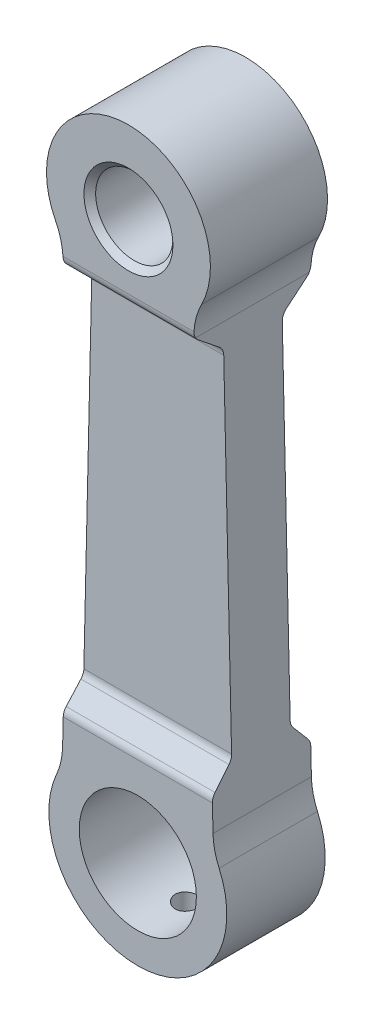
ISO-10303-21;
HEADER;
FILE_DESCRIPTION(('STEP AP214'),'2;1');
FILE_NAME('part.step','',(''),(''),'','','');
FILE_SCHEMA(('AUTOMOTIVE_DESIGN { 1 0 10303 214 1 1 1 1 }'));
ENDSEC;
DATA;
#1=APPLICATION_CONTEXT('core data for automotive mechanical design processes');
#2=APPLICATION_PROTOCOL_DEFINITION('international standard','automotive_design',2000,#1);
#3=PRODUCT_CONTEXT('',#1,'mechanical');
#4=PRODUCT('Part','Part','',(#3));
#5=PRODUCT_RELATED_PRODUCT_CATEGORY('part','',(#4));
#6=PRODUCT_DEFINITION_FORMATION('','',#4);
#7=PRODUCT_DEFINITION_CONTEXT('part definition',#1,'design');
#8=PRODUCT_DEFINITION('design','',#6,#7);
#9=PRODUCT_DEFINITION_SHAPE('','',#8);
#10=(LENGTH_UNIT() NAMED_UNIT(*) SI_UNIT(.MILLI.,.METRE.));
#11=(NAMED_UNIT(*) PLANE_ANGLE_UNIT() SI_UNIT($,.RADIAN.));
#12=(NAMED_UNIT(*) SI_UNIT($,.STERADIAN.) SOLID_ANGLE_UNIT());
#13=UNCERTAINTY_MEASURE_WITH_UNIT(LENGTH_MEASURE(1.E-05),#10,'distance_accuracy_value','');
#14=(GEOMETRIC_REPRESENTATION_CONTEXT(3) GLOBAL_UNCERTAINTY_ASSIGNED_CONTEXT((#13)) GLOBAL_UNIT_ASSIGNED_CONTEXT((#10,
#11,#12)) REPRESENTATION_CONTEXT('',''));
#15=CARTESIAN_POINT('',(0.,0.,0.));
#16=DIRECTION('',(0.,0.,1.));
#17=DIRECTION('',(1.,0.,0.));
#18=AXIS2_PLACEMENT_3D('',#15,#16,#17);
#19=CARTESIAN_POINT('',(-3.8,-20.,2.1));
#20=DIRECTION('',(0.,0.,-1.));
#21=DIRECTION('',(0.,1.,0.));
#22=AXIS2_PLACEMENT_3D('',#19,#20,#21);
#23=PLANE('',#22);
#24=DIRECTION('',(0.0229755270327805,-0.999736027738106,0.));
#25=VECTOR('',#24,1.);
#26=CARTESIAN_POINT('',(2.79079191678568,-3.02289002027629,2.1));
#27=LINE('',#26,#25);
#28=CARTESIAN_POINT('',(3.1851767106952,-20.1837885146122,2.1));
#29=VERTEX_POINT('',#28);
#30=CARTESIAN_POINT('',(3.21079191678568,-21.2983851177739,2.1));
#31=VERTEX_POINT('',#30);
#32=EDGE_CURVE('E538',#29,#31,#27,.T.);
#33=ORIENTED_EDGE('',*,*,#32,.F.);
#34=DIRECTION('',(1.,0.,0.));
#35=VECTOR('',#34,1.);
#36=CARTESIAN_POINT('',(-3.8,-20.1837885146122,2.1));
#37=LINE('',#36,#35);
#38=CARTESIAN_POINT('',(-3.1851767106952,-20.1837885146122,2.1));
#39=VERTEX_POINT('',#38);
#40=EDGE_CURVE('E783',#29,#39,#37,.F.);
#41=ORIENTED_EDGE('',*,*,#40,.T.);
#42=DIRECTION('',(0.0229755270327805,0.999736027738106,0.));
#43=VECTOR('',#42,1.);
#44=CARTESIAN_POINT('',(-2.79079191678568,-3.02289002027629,2.1));
#45=LINE('',#44,#43);
#46=CARTESIAN_POINT('',(-3.21079191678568,-21.2983851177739,2.1));
#47=VERTEX_POINT('',#46);
#48=EDGE_CURVE('E827',#47,#39,#45,.T.);
#49=ORIENTED_EDGE('',*,*,#48,.F.);
#50=CARTESIAN_POINT('',(-6.21,-21.2294585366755,2.1));
#51=DIRECTION('',(0.,0.,-1.));
#52=DIRECTION('',(0.,1.,0.));
#53=AXIS2_PLACEMENT_3D('',#50,#51,#52);
#54=CIRCLE('',#53,3.);
#55=CARTESIAN_POINT('',(-3.47029411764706,-22.4517562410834,2.1));
#56=VERTEX_POINT('',#55);
#57=EDGE_CURVE('E824',#56,#47,#54,.F.);
#58=ORIENTED_EDGE('',*,*,#57,.F.);
#59=CARTESIAN_POINT('',(0.,-24.,2.1));
#60=DIRECTION('',(0.,0.,-1.));
#61=DIRECTION('',(0.,1.,0.));
#62=AXIS2_PLACEMENT_3D('',#59,#60,#61);
#63=CIRCLE('',#62,3.8);
#64=CARTESIAN_POINT('',(3.47029411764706,-22.4517562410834,2.1));
#65=VERTEX_POINT('',#64);
#66=EDGE_CURVE('E817',#65,#56,#63,.T.);
#67=ORIENTED_EDGE('',*,*,#66,.F.);
#68=CARTESIAN_POINT('',(6.21,-21.2294585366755,2.1));
#69=DIRECTION('',(0.,0.,-1.));
#70=DIRECTION('',(0.,1.,0.));
#71=AXIS2_PLACEMENT_3D('',#68,#69,#70);
#72=CIRCLE('',#71,3.);
#73=EDGE_CURVE('E815',#31,#65,#72,.F.);
#74=ORIENTED_EDGE('',*,*,#73,.F.);
#75=EDGE_LOOP('',(#33,#41,#49,#58,#67,#74));
#76=FACE_BOUND('',#75,.T.);
#77=CARTESIAN_POINT('',(0.,-24.,2.1));
#78=DIRECTION('',(0.,0.,-1.));
#79=DIRECTION('',(0.,1.,0.));
#80=AXIS2_PLACEMENT_3D('',#77,#78,#79);
#81=CIRCLE('',#80,2.5);
#82=CARTESIAN_POINT('',(0.,-21.5,2.1));
#83=VERTEX_POINT('',#82);
#84=EDGE_CURVE('E571',#83,#83,#81,.F.);
#85=ORIENTED_EDGE('',*,*,#84,.F.);
#86=EDGE_LOOP('',(#85));
#87=FACE_BOUND('',#86,.T.);
#88=ADVANCED_FACE('F350',(#76,#87),#23,.F.);
#89=CARTESIAN_POINT('',(-3.8,-20.,-2.1));
#90=DIRECTION('',(0.,0.,1.));
#91=DIRECTION('',(0.,-1.,0.));
#92=AXIS2_PLACEMENT_3D('',#89,#90,#91);
#93=PLANE('',#92);
#94=DIRECTION('',(-0.0229755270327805,-0.999736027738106,0.));
#95=VECTOR('',#94,1.);
#96=CARTESIAN_POINT('',(-2.79079191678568,-3.02289002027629,-2.1));
#97=LINE('',#96,#95);
#98=CARTESIAN_POINT('',(-3.1851767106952,-20.1837885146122,-2.1));
#99=VERTEX_POINT('',#98);
#100=CARTESIAN_POINT('',(-3.21079191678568,-21.2983851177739,-2.1));
#101=VERTEX_POINT('',#100);
#102=EDGE_CURVE('E819',#99,#101,#97,.T.);
#103=ORIENTED_EDGE('',*,*,#102,.F.);
#104=DIRECTION('',(1.,0.,0.));
#105=VECTOR('',#104,1.);
#106=CARTESIAN_POINT('',(-3.8,-20.1837885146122,-2.1));
#107=LINE('',#106,#105);
#108=CARTESIAN_POINT('',(3.1851767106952,-20.1837885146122,-2.1));
#109=VERTEX_POINT('',#108);
#110=EDGE_CURVE('E521',#99,#109,#107,.T.);
#111=ORIENTED_EDGE('',*,*,#110,.T.);
#112=DIRECTION('',(-0.0229755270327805,0.999736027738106,0.));
#113=VECTOR('',#112,1.);
#114=CARTESIAN_POINT('',(2.79079191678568,-3.02289002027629,-2.1));
#115=LINE('',#114,#113);
#116=CARTESIAN_POINT('',(3.21079191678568,-21.2983851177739,-2.1));
#117=VERTEX_POINT('',#116);
#118=EDGE_CURVE('E513',#117,#109,#115,.T.);
#119=ORIENTED_EDGE('',*,*,#118,.F.);
#120=CARTESIAN_POINT('',(6.21,-21.2294585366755,-2.1));
#121=DIRECTION('',(0.,0.,1.));
#122=DIRECTION('',(0.,-1.,0.));
#123=AXIS2_PLACEMENT_3D('',#120,#121,#122);
#124=CIRCLE('',#123,3.);
#125=CARTESIAN_POINT('',(3.47029411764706,-22.4517562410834,-2.1));
#126=VERTEX_POINT('',#125);
#127=EDGE_CURVE('E518',#126,#117,#124,.F.);
#128=ORIENTED_EDGE('',*,*,#127,.F.);
#129=CARTESIAN_POINT('',(0.,-24.,-2.1));
#130=DIRECTION('',(0.,0.,1.));
#131=DIRECTION('',(0.,-1.,0.));
#132=AXIS2_PLACEMENT_3D('',#129,#130,#131);
#133=CIRCLE('',#132,3.8);
#134=CARTESIAN_POINT('',(-3.47029411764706,-22.4517562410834,-2.1));
#135=VERTEX_POINT('',#134);
#136=EDGE_CURVE('E533',#135,#126,#133,.T.);
#137=ORIENTED_EDGE('',*,*,#136,.F.);
#138=CARTESIAN_POINT('',(-6.21,-21.2294585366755,-2.1));
#139=DIRECTION('',(0.,0.,1.));
#140=DIRECTION('',(0.,-1.,0.));
#141=AXIS2_PLACEMENT_3D('',#138,#139,#140);
#142=CIRCLE('',#141,3.);
#143=EDGE_CURVE('E880',#101,#135,#142,.F.);
#144=ORIENTED_EDGE('',*,*,#143,.F.);
#145=EDGE_LOOP('',(#103,#111,#119,#128,#137,#144));
#146=FACE_BOUND('',#145,.T.);
#147=CARTESIAN_POINT('',(0.,-24.,-2.1));
#148=DIRECTION('',(0.,0.,1.));
#149=DIRECTION('',(0.,-1.,0.));
#150=AXIS2_PLACEMENT_3D('',#147,#148,#149);
#151=CIRCLE('',#150,2.5);
#152=CARTESIAN_POINT('',(0.,-26.5,-2.1));
#153=VERTEX_POINT('',#152);
#154=EDGE_CURVE('E568',#153,#153,#151,.F.);
#155=ORIENTED_EDGE('',*,*,#154,.F.);
#156=EDGE_LOOP('',(#155));
#157=FACE_BOUND('',#156,.T.);
#158=ADVANCED_FACE('F516',(#146,#157),#93,.F.);
#159=CARTESIAN_POINT('',(-5.79,-2.95396343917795,2.5));
#160=DIRECTION('',(0.,0.,1.));
#161=DIRECTION('',(1.,0.,0.));
#162=AXIS2_PLACEMENT_3D('',#159,#160,#161);
#163=PLANE('',#162);
#164=CARTESIAN_POINT('',(0.,0.,2.5));
#165=DIRECTION('',(0.,0.,1.));
#166=DIRECTION('',(1.,0.,0.));
#167=AXIS2_PLACEMENT_3D('',#164,#165,#166);
#168=CIRCLE('',#167,1.9);
#169=CARTESIAN_POINT('',(1.9,0.,2.5));
#170=VERTEX_POINT('',#169);
#171=EDGE_CURVE('E359',#170,#170,#168,.F.);
#172=ORIENTED_EDGE('',*,*,#171,.T.);
#173=EDGE_LOOP('',(#172));
#174=FACE_BOUND('',#173,.T.);
#175=CARTESIAN_POINT('',(-5.79,-2.95396343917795,2.5));
#176=DIRECTION('',(0.,0.,-1.));
#177=DIRECTION('',(1.,0.,0.));
#178=AXIS2_PLACEMENT_3D('',#175,#176,#177);
#179=CIRCLE('',#178,3.);
#180=CARTESIAN_POINT('',(-3.11769230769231,-1.59059569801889,2.5));
#181=VERTEX_POINT('',#180);
#182=CARTESIAN_POINT('',(-2.79629712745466,-2.7596875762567,2.5));
#183=VERTEX_POINT('',#182);
#184=EDGE_CURVE('E835',#181,#183,#179,.T.);
#185=ORIENTED_EDGE('',*,*,#184,.T.);
#186=DIRECTION('',(-1.,0.,0.));
#187=VECTOR('',#186,1.);
#188=CARTESIAN_POINT('',(2.79035324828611,-2.7596875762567,2.5));
#189=LINE('',#188,#187);
#190=CARTESIAN_POINT('',(2.79629712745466,-2.7596875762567,2.5));
#191=VERTEX_POINT('',#190);
#192=EDGE_CURVE('E676',#183,#191,#189,.F.);
#193=ORIENTED_EDGE('',*,*,#192,.T.);
#194=CARTESIAN_POINT('',(5.79,-2.95396343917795,2.5));
#195=DIRECTION('',(0.,0.,-1.));
#196=DIRECTION('',(-1.,0.,0.));
#197=AXIS2_PLACEMENT_3D('',#194,#195,#196);
#198=CIRCLE('',#197,3.);
#199=CARTESIAN_POINT('',(3.11769230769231,-1.5905956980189,2.5));
#200=VERTEX_POINT('',#199);
#201=EDGE_CURVE('E837',#191,#200,#198,.T.);
#202=ORIENTED_EDGE('',*,*,#201,.T.);
#203=CARTESIAN_POINT('',(0.,0.,2.5));
#204=DIRECTION('',(0.,0.,1.));
#205=DIRECTION('',(1.,0.,0.));
#206=AXIS2_PLACEMENT_3D('',#203,#204,#205);
#207=CIRCLE('',#206,3.5);
#208=EDGE_CURVE('E839',#200,#181,#207,.T.);
#209=ORIENTED_EDGE('',*,*,#208,.T.);
#210=EDGE_LOOP('',(#185,#193,#202,#209));
#211=FACE_BOUND('',#210,.T.);
#212=ADVANCED_FACE('F624',(#174,#211),#163,.T.);
#213=CARTESIAN_POINT('',(-5.79,-2.95396343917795,-2.5));
#214=DIRECTION('',(0.,0.,1.));
#215=DIRECTION('',(1.,0.,0.));
#216=AXIS2_PLACEMENT_3D('',#213,#214,#215);
#217=PLANE('',#216);
#218=CARTESIAN_POINT('',(0.,0.,-2.5));
#219=DIRECTION('',(0.,0.,1.));
#220=DIRECTION('',(1.,0.,0.));
#221=AXIS2_PLACEMENT_3D('',#218,#219,#220);
#222=CIRCLE('',#221,1.9);
#223=CARTESIAN_POINT('',(1.9,0.,-2.5));
#224=VERTEX_POINT('',#223);
#225=EDGE_CURVE('E11',#224,#224,#222,.T.);
#226=ORIENTED_EDGE('',*,*,#225,.T.);
#227=EDGE_LOOP('',(#226));
#228=FACE_BOUND('',#227,.T.);
#229=CARTESIAN_POINT('',(5.79,-2.95396343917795,-2.5));
#230=DIRECTION('',(0.,0.,-1.));
#231=DIRECTION('',(-1.,0.,0.));
#232=AXIS2_PLACEMENT_3D('',#229,#230,#231);
#233=CIRCLE('',#232,3.);
#234=CARTESIAN_POINT('',(2.79629712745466,-2.7596875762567,-2.5));
#235=VERTEX_POINT('',#234);
#236=CARTESIAN_POINT('',(3.11769230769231,-1.5905956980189,-2.5));
#237=VERTEX_POINT('',#236);
#238=EDGE_CURVE('E689',#235,#237,#233,.T.);
#239=ORIENTED_EDGE('',*,*,#238,.F.);
#240=DIRECTION('',(-1.,0.,0.));
#241=VECTOR('',#240,1.);
#242=CARTESIAN_POINT('',(-5.79,-2.7596875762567,-2.5));
#243=LINE('',#242,#241);
#244=CARTESIAN_POINT('',(-2.79629712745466,-2.7596875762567,-2.5));
#245=VERTEX_POINT('',#244);
#246=EDGE_CURVE('E698',#235,#245,#243,.T.);
#247=ORIENTED_EDGE('',*,*,#246,.T.);
#248=CARTESIAN_POINT('',(-5.79,-2.95396343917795,-2.5));
#249=DIRECTION('',(0.,0.,-1.));
#250=DIRECTION('',(1.,0.,0.));
#251=AXIS2_PLACEMENT_3D('',#248,#249,#250);
#252=CIRCLE('',#251,3.);
#253=CARTESIAN_POINT('',(-3.11769230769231,-1.59059569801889,-2.5));
#254=VERTEX_POINT('',#253);
#255=EDGE_CURVE('E701',#254,#245,#252,.T.);
#256=ORIENTED_EDGE('',*,*,#255,.F.);
#257=CARTESIAN_POINT('',(0.,0.,-2.5));
#258=DIRECTION('',(0.,0.,1.));
#259=DIRECTION('',(1.,0.,0.));
#260=AXIS2_PLACEMENT_3D('',#257,#258,#259);
#261=CIRCLE('',#260,3.5);
#262=EDGE_CURVE('E700',#237,#254,#261,.T.);
#263=ORIENTED_EDGE('',*,*,#262,.F.);
#264=EDGE_LOOP('',(#239,#247,#256,#263));
#265=FACE_BOUND('',#264,.T.);
#266=ADVANCED_FACE('F615',(#228,#265),#217,.F.);
#267=CARTESIAN_POINT('',(-5.79,-2.95396343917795,2.5));
#268=DIRECTION('',(0.,0.,-1.));
#269=DIRECTION('',(-1.,0.,0.));
#270=AXIS2_PLACEMENT_3D('',#267,#268,#269);
#271=CYLINDRICAL_SURFACE('',#270,3.);
#272=DIRECTION('',(0.,0.,-1.));
#273=VECTOR('',#272,1.);
#274=CARTESIAN_POINT('',(-2.79079191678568,-3.02289002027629,2.5));
#275=LINE('',#274,#273);
#276=CARTESIAN_POINT('',(-2.79079191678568,-3.02289002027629,2.42511701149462));
#277=VERTEX_POINT('',#276);
#278=CARTESIAN_POINT('',(-2.79079191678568,-3.02289002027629,-2.42511701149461));
#279=VERTEX_POINT('',#278);
#280=EDGE_CURVE('E554',#277,#279,#275,.T.);
#281=ORIENTED_EDGE('',*,*,#280,.F.);
#282=CARTESIAN_POINT('',(-2.79079191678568,-3.02289002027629,2.42511701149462));
#283=CARTESIAN_POINT('',(-2.79022978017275,-2.99898463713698,2.43995262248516));
#284=CARTESIAN_POINT('',(-2.78994860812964,-2.97378583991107,2.45272781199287));
#285=CARTESIAN_POINT('',(-2.79006314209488,-2.92221094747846,2.47363979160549));
#286=CARTESIAN_POINT('',(-2.79044337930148,-2.89587543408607,2.4818768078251));
#287=CARTESIAN_POINT('',(-2.79170512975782,-2.85125631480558,2.49188410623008));
#288=CARTESIAN_POINT('',(-2.79237558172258,-2.83323668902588,2.49489692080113));
#289=CARTESIAN_POINT('',(-2.79406738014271,-2.79670786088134,2.49897152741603));
#290=CARTESIAN_POINT('',(-2.79509405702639,-2.77819541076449,2.50000202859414));
#291=CARTESIAN_POINT('',(-2.79629712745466,-2.7596875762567,2.5));
#292=B_SPLINE_CURVE_WITH_KNOTS('',3,(#282,#283,#284,#285,#286,#287,#288,#289,#290,#291),
.UNSPECIFIED.,.F.,.F.,(4,2,2,2,4),(0.,0.0843382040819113,0.166730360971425,0.221470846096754,
0.277068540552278),.UNSPECIFIED.);
#293=EDGE_CURVE('E671',#277,#183,#292,.T.);
#294=ORIENTED_EDGE('',*,*,#293,.T.);
#295=ORIENTED_EDGE('',*,*,#184,.F.);
#296=DIRECTION('',(0.,0.,-1.));
#297=VECTOR('',#296,1.);
#298=CARTESIAN_POINT('',(-3.11769230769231,-1.59059569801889,2.5));
#299=LINE('',#298,#297);
#300=EDGE_CURVE('E841',#181,#254,#299,.T.);
#301=ORIENTED_EDGE('',*,*,#300,.T.);
#302=ORIENTED_EDGE('',*,*,#255,.T.);
#303=CARTESIAN_POINT('',(-2.79629712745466,-2.7596875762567,-2.5));
#304=CARTESIAN_POINT('',(-2.79445910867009,-2.78776843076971,-2.50003042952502));
#305=CARTESIAN_POINT('',(-2.79304678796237,-2.81588342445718,-2.49763600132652));
#306=CARTESIAN_POINT('',(-2.79103699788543,-2.87070593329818,-2.48828499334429));
#307=CARTESIAN_POINT('',(-2.79042149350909,-2.8974309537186,-2.48143486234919));
#308=CARTESIAN_POINT('',(-2.78997908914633,-2.9406541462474,-2.46646139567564));
#309=CARTESIAN_POINT('',(-2.78995687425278,-2.95757485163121,-2.45953657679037));
#310=CARTESIAN_POINT('',(-2.79017956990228,-2.99081664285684,-2.44376019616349));
#311=CARTESIAN_POINT('',(-2.79042866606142,-3.00712420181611,-2.43488017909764));
#312=CARTESIAN_POINT('',(-2.79079191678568,-3.02289002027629,-2.42511701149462));
#313=B_SPLINE_CURVE_WITH_KNOTS('',3,(#303,#304,#305,#306,#307,#308,#309,#310,#311,#312),
.UNSPECIFIED.,.F.,.F.,(4,2,2,2,4),(0.,0.0843340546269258,0.166723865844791,0.221467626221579,
0.27706805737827),.UNSPECIFIED.);
#314=EDGE_CURVE('E677',#245,#279,#313,.T.);
#315=ORIENTED_EDGE('',*,*,#314,.T.);
#316=EDGE_LOOP('',(#281,#294,#295,#301,#302,#315));
#317=FACE_BOUND('',#316,.T.);
#318=ADVANCED_FACE('F352',(#317),#271,.F.);
#319=CARTESIAN_POINT('',(-2.79079191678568,-3.02289002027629,2.5));
#320=DIRECTION('',(0.999736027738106,-0.0229755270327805,0.));
#321=DIRECTION('',(0.0229755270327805,0.999736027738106,0.));
#322=AXIS2_PLACEMENT_3D('',#319,#320,#321);
#323=PLANE('',#322);
#324=DIRECTION('',(0.0143550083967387,0.624630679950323,0.780788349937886));
#325=VECTOR('',#324,1.);
#326=CARTESIAN_POINT('',(-2.79047122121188,-3.00893556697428,2.48883054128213));
#327=LINE('',#326,#325);
#328=CARTESIAN_POINT('',(-2.80979741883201,-3.84987801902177,1.43765247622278));
#329=VERTEX_POINT('',#328);
#330=CARTESIAN_POINT('',(-2.79371590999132,-3.15012198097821,2.31234752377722));
#331=VERTEX_POINT('',#330);
#332=EDGE_CURVE('E809',#329,#331,#327,.T.);
#333=ORIENTED_EDGE('',*,*,#332,.T.);
#334=CARTESIAN_POINT('',(-2.78474310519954,-2.7596875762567,2.));
#335=DIRECTION('',(0.999736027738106,-0.0229755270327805,0.));
#336=DIRECTION('',(0.0229755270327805,0.999736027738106,0.));
#337=AXIS2_PLACEMENT_3D('',#334,#335,#336);
#338=ELLIPSE('',#337,0.500132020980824,0.5);
#339=EDGE_CURVE('E788',#331,#277,#338,.F.);
#340=ORIENTED_EDGE('',*,*,#339,.T.);
#341=ORIENTED_EDGE('',*,*,#280,.T.);
#342=CARTESIAN_POINT('',(-2.78474310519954,-2.7596875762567,-2.));
#343=DIRECTION('',(0.999736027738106,-0.0229755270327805,0.));
#344=DIRECTION('',(-0.0229755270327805,-0.999736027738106,0.));
#345=AXIS2_PLACEMENT_3D('',#342,#343,#344);
#346=ELLIPSE('',#345,0.500132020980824,0.5);
#347=CARTESIAN_POINT('',(-2.79371590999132,-3.15012198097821,-2.31234752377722));
#348=VERTEX_POINT('',#347);
#349=EDGE_CURVE('E789',#279,#348,#346,.F.);
#350=ORIENTED_EDGE('',*,*,#349,.T.);
#351=DIRECTION('',(-0.0143550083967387,-0.624630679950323,0.780788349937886));
#352=VECTOR('',#351,1.);
#353=CARTESIAN_POINT('',(-2.84651233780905,-5.44745735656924,0.559321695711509));
#354=LINE('',#353,#352);
#355=CARTESIAN_POINT('',(-2.80979741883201,-3.84987801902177,-1.43765247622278));
#356=VERTEX_POINT('',#355);
#357=EDGE_CURVE('E868',#348,#356,#354,.T.);
#358=ORIENTED_EDGE('',*,*,#357,.T.);
#359=CARTESIAN_POINT('',(-2.81877022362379,-4.24031242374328,-1.75));
#360=DIRECTION('',(0.999736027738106,-0.0229755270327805,0.));
#361=DIRECTION('',(-0.0229755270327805,-0.999736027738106,0.));
#362=AXIS2_PLACEMENT_3D('',#359,#360,#361);
#363=ELLIPSE('',#362,0.500132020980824,0.5);
#364=CARTESIAN_POINT('',(-2.81877022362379,-4.24031242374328,-1.25));
#365=VERTEX_POINT('',#364);
#366=EDGE_CURVE('E727',#356,#365,#363,.T.);
#367=ORIENTED_EDGE('',*,*,#366,.T.);
#368=DIRECTION('',(-0.0229755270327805,-0.999736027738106,0.));
#369=VECTOR('',#368,1.);
#370=CARTESIAN_POINT('',(-2.79079191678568,-3.02289002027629,-1.25));
#371=LINE('',#370,#369);
#372=CARTESIAN_POINT('',(-3.15374761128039,-18.8162114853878,-1.25));
#373=VERTEX_POINT('',#372);
#374=EDGE_CURVE('E885',#365,#373,#371,.T.);
#375=ORIENTED_EDGE('',*,*,#374,.T.);
#376=CARTESIAN_POINT('',(-3.15374761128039,-18.8162114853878,-1.75));
#377=DIRECTION('',(0.999736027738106,-0.0229755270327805,0.));
#378=DIRECTION('',(-0.0229755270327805,-0.999736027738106,0.));
#379=AXIS2_PLACEMENT_3D('',#376,#377,#378);
#380=ELLIPSE('',#379,0.500132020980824,0.5);
#381=CARTESIAN_POINT('',(-3.16118960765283,-19.1400356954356,-1.36903034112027));
#382=VERTEX_POINT('',#381);
#383=EDGE_CURVE('E731',#373,#382,#380,.T.);
#384=ORIENTED_EDGE('',*,*,#383,.T.);
#385=DIRECTION('',(-0.0175078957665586,-0.761822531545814,-0.647549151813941));
#386=VECTOR('',#385,1.);
#387=CARTESIAN_POINT('',(-2.90224298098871,-7.87246949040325,8.20840093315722));
#388=LINE('',#387,#386);
#389=CARTESIAN_POINT('',(-3.17773471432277,-19.8599643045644,-1.98096965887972));
#390=VERTEX_POINT('',#389);
#391=EDGE_CURVE('E534',#382,#390,#388,.T.);
#392=ORIENTED_EDGE('',*,*,#391,.T.);
#393=CARTESIAN_POINT('',(-3.1851767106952,-20.1837885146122,-1.6));
#394=DIRECTION('',(0.999736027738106,-0.0229755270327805,0.));
#395=DIRECTION('',(0.0229755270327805,0.999736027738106,0.));
#396=AXIS2_PLACEMENT_3D('',#393,#394,#395);
#397=ELLIPSE('',#396,0.500132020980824,0.5);
#398=EDGE_CURVE('E791',#390,#99,#397,.F.);
#399=ORIENTED_EDGE('',*,*,#398,.T.);
#400=ORIENTED_EDGE('',*,*,#102,.T.);
#401=DIRECTION('',(0.,0.,-1.));
#402=VECTOR('',#401,1.);
#403=CARTESIAN_POINT('',(-3.21079191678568,-21.2983851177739,2.5));
#404=LINE('',#403,#402);
#405=EDGE_CURVE('E551',#47,#101,#404,.T.);
#406=ORIENTED_EDGE('',*,*,#405,.F.);
#407=ORIENTED_EDGE('',*,*,#48,.T.);
#408=CARTESIAN_POINT('',(-3.1851767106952,-20.1837885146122,1.6));
#409=DIRECTION('',(0.999736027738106,-0.0229755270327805,0.));
#410=DIRECTION('',(0.0229755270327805,0.999736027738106,0.));
#411=AXIS2_PLACEMENT_3D('',#408,#409,#410);
#412=ELLIPSE('',#411,0.500132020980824,0.5);
#413=CARTESIAN_POINT('',(-3.17773471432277,-19.8599643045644,1.98096965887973));
#414=VERTEX_POINT('',#413);
#415=EDGE_CURVE('E782',#39,#414,#412,.F.);
#416=ORIENTED_EDGE('',*,*,#415,.T.);
#417=DIRECTION('',(0.0175078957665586,0.761822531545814,-0.647549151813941));
#418=VECTOR('',#417,1.);
#419=CARTESIAN_POINT('',(-2.95892909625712,-10.3390571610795,-6.11180141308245));
#420=LINE('',#419,#418);
#421=CARTESIAN_POINT('',(-3.16118960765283,-19.1400356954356,1.36903034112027));
#422=VERTEX_POINT('',#421);
#423=EDGE_CURVE('E829',#414,#422,#420,.T.);
#424=ORIENTED_EDGE('',*,*,#423,.T.);
#425=CARTESIAN_POINT('',(-3.15374761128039,-18.8162114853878,1.75));
#426=DIRECTION('',(0.999736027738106,-0.0229755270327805,0.));
#427=DIRECTION('',(-0.0229755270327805,-0.999736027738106,0.));
#428=AXIS2_PLACEMENT_3D('',#425,#426,#427);
#429=ELLIPSE('',#428,0.500132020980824,0.5);
#430=CARTESIAN_POINT('',(-3.15374761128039,-18.8162114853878,1.25));
#431=VERTEX_POINT('',#430);
#432=EDGE_CURVE('E723',#422,#431,#429,.T.);
#433=ORIENTED_EDGE('',*,*,#432,.T.);
#434=DIRECTION('',(0.0229755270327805,0.999736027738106,0.));
#435=VECTOR('',#434,1.);
#436=CARTESIAN_POINT('',(-2.79079191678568,-3.02289002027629,1.25));
#437=LINE('',#436,#435);
#438=CARTESIAN_POINT('',(-2.81877022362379,-4.24031242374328,1.25));
#439=VERTEX_POINT('',#438);
#440=EDGE_CURVE('E831',#431,#439,#437,.T.);
#441=ORIENTED_EDGE('',*,*,#440,.T.);
#442=CARTESIAN_POINT('',(-2.81877022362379,-4.24031242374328,1.75));
#443=DIRECTION('',(0.999736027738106,-0.0229755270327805,0.));
#444=DIRECTION('',(-0.0229755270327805,-0.999736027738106,0.));
#445=AXIS2_PLACEMENT_3D('',#442,#443,#444);
#446=ELLIPSE('',#445,0.500132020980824,0.5);
#447=EDGE_CURVE('E719',#439,#329,#446,.T.);
#448=ORIENTED_EDGE('',*,*,#447,.T.);
#449=EDGE_LOOP('',(#333,#340,#341,#350,#358,#367,#375,#384,#392,#399,#400,#406,#407,#416,#424,
#433,#441,#448));
#450=FACE_BOUND('',#449,.T.);
#451=ADVANCED_FACE('F608',(#450),#323,.F.);
#452=CARTESIAN_POINT('',(-6.21,-21.2294585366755,2.5));
#453=DIRECTION('',(0.,0.,-1.));
#454=DIRECTION('',(-1.,0.,0.));
#455=AXIS2_PLACEMENT_3D('',#452,#453,#454);
#456=CYLINDRICAL_SURFACE('',#455,3.);
#457=ORIENTED_EDGE('',*,*,#405,.T.);
#458=ORIENTED_EDGE('',*,*,#143,.T.);
#459=DIRECTION('',(0.,0.,-1.));
#460=VECTOR('',#459,1.);
#461=CARTESIAN_POINT('',(-3.47029411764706,-22.4517562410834,2.5));
#462=LINE('',#461,#460);
#463=EDGE_CURVE('E542',#56,#135,#462,.T.);
#464=ORIENTED_EDGE('',*,*,#463,.F.);
#465=ORIENTED_EDGE('',*,*,#57,.T.);
#466=EDGE_LOOP('',(#457,#458,#464,#465));
#467=FACE_BOUND('',#466,.T.);
#468=ADVANCED_FACE('F604',(#467),#456,.F.);
#469=CARTESIAN_POINT('',(0.,-24.,2.5));
#470=DIRECTION('',(0.,0.,-1.));
#471=DIRECTION('',(-1.,0.,0.));
#472=AXIS2_PLACEMENT_3D('',#469,#470,#471);
#473=CYLINDRICAL_SURFACE('',#472,3.8);
#474=CARTESIAN_POINT('',(0.,-27.8,0.5));
#475=CARTESIAN_POINT('',(0.0279556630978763,-27.7999995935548,0.499998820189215));
#476=CARTESIAN_POINT('',(0.0559284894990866,-27.7996882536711,0.497647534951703));
#477=CARTESIAN_POINT('',(0.111094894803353,-27.7984762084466,0.48830540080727));
#478=CARTESIAN_POINT('',(0.138287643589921,-27.7975748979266,0.481309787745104));
#479=CARTESIAN_POINT('',(0.191087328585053,-27.7952843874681,0.462889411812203));
#480=CARTESIAN_POINT('',(0.216695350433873,-27.7938955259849,0.451467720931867));
#481=CARTESIAN_POINT('',(0.265626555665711,-27.7907841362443,0.424526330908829));
#482=CARTESIAN_POINT('',(0.288950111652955,-27.7890616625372,0.409007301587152));
#483=CARTESIAN_POINT('',(0.332796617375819,-27.7854634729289,0.374211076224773));
#484=CARTESIAN_POINT('',(0.353303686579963,-27.7835869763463,0.354913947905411));
#485=CARTESIAN_POINT('',(0.390798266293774,-27.779898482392,0.313152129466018));
#486=CARTESIAN_POINT('',(0.407785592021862,-27.7780864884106,0.290687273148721));
#487=CARTESIAN_POINT('',(0.437818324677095,-27.7747245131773,0.243123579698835));
#488=CARTESIAN_POINT('',(0.450848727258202,-27.7731755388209,0.218015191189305));
#489=CARTESIAN_POINT('',(0.472501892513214,-27.7705253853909,0.165942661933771));
#490=CARTESIAN_POINT('',(0.481124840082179,-27.7694241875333,0.138978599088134));
#491=CARTESIAN_POINT('',(0.493669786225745,-27.767801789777,0.0841255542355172));
#492=CARTESIAN_POINT('',(0.497618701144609,-27.7672772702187,0.0562428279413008));
#493=CARTESIAN_POINT('',(0.500786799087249,-27.7668574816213,0.000205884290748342));
#494=CARTESIAN_POINT('',(0.500006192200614,-27.7669621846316,-0.0279483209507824));
#495=CARTESIAN_POINT('',(0.493759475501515,-27.7677859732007,-0.0835408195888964));
#496=CARTESIAN_POINT('',(0.488323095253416,-27.7685011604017,-0.110982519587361));
#497=CARTESIAN_POINT('',(0.4729655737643,-27.7704592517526,-0.164560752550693));
#498=CARTESIAN_POINT('',(0.463044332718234,-27.7717021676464,-0.190697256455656));
#499=CARTESIAN_POINT('',(0.43896701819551,-27.7745800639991,-0.241015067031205));
#500=CARTESIAN_POINT('',(0.424798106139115,-27.7762162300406,-0.265190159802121));
#501=CARTESIAN_POINT('',(0.392636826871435,-27.7796953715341,-0.310830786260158));
#502=CARTESIAN_POINT('',(0.374644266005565,-27.7815383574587,-0.332296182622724));
#503=CARTESIAN_POINT('',(0.335182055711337,-27.7852407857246,-0.372080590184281));
#504=CARTESIAN_POINT('',(0.313686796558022,-27.7871002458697,-0.390374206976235));
#505=CARTESIAN_POINT('',(0.267917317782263,-27.790612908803,-0.42309776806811));
#506=CARTESIAN_POINT('',(0.243643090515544,-27.7922661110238,-0.437527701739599));
#507=CARTESIAN_POINT('',(0.192984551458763,-27.7951811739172,-0.462114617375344));
#508=CARTESIAN_POINT('',(0.166599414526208,-27.796442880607,-0.472269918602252));
#509=CARTESIAN_POINT('',(0.112478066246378,-27.7984314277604,-0.487998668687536));
#510=CARTESIAN_POINT('',(0.0847419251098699,-27.7991582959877,-0.493572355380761));
#511=CARTESIAN_POINT('',(0.0289253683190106,-27.7999916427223,-0.499946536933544));
#512=CARTESIAN_POINT('',(0.0008490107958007,-27.8001026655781,-0.500781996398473));
#513=CARTESIAN_POINT('',(-0.0550433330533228,-27.7997041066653,-0.49774841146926));
#514=CARTESIAN_POINT('',(-0.0828593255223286,-27.7991945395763,-0.493879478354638));
#515=CARTESIAN_POINT('',(-0.137337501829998,-27.7976148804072,-0.481575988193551));
#516=CARTESIAN_POINT('',(-0.164003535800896,-27.7965468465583,-0.473158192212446));
#517=CARTESIAN_POINT('',(-0.215545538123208,-27.7939697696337,-0.452013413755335));
#518=CARTESIAN_POINT('',(-0.240421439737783,-27.7924607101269,-0.439286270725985));
#519=CARTESIAN_POINT('',(-0.287832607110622,-27.7891583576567,-0.409800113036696));
#520=CARTESIAN_POINT('',(-0.310353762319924,-27.7873634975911,-0.393018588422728));
#521=CARTESIAN_POINT('',(-0.35227236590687,-27.7836949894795,-0.355931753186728));
#522=CARTESIAN_POINT('',(-0.371669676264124,-27.7818213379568,-0.335626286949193));
#523=CARTESIAN_POINT('',(-0.40691481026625,-27.778192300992,-0.291913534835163));
#524=CARTESIAN_POINT('',(-0.422739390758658,-27.7764377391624,-0.268487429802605));
#525=CARTESIAN_POINT('',(-0.450229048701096,-27.7732593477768,-0.219289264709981));
#526=CARTESIAN_POINT('',(-0.461894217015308,-27.7718355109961,-0.19351725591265));
#527=CARTESIAN_POINT('',(-0.480696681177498,-27.7694854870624,-0.140432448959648));
#528=CARTESIAN_POINT('',(-0.487846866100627,-27.768557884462,-0.113124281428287));
#529=CARTESIAN_POINT('',(-0.497457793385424,-27.7673013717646,-0.0576818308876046));
#530=CARTESIAN_POINT('',(-0.499918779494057,-27.766972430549,-0.0295475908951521));
#531=CARTESIAN_POINT('',(-0.500076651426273,-27.7669514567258,0.0265170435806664));
#532=CARTESIAN_POINT('',(-0.49781005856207,-27.7672545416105,0.0544473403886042));
#533=CARTESIAN_POINT('',(-0.488654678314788,-27.7684529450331,0.109526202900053));
#534=CARTESIAN_POINT('',(-0.481765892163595,-27.7693482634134,0.136674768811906));
#535=CARTESIAN_POINT('',(-0.463573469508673,-27.7716286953,0.189413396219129));
#536=CARTESIAN_POINT('',(-0.452271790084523,-27.7730135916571,0.21500414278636));
#537=CARTESIAN_POINT('',(-0.425577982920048,-27.7761174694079,0.26393194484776));
#538=CARTESIAN_POINT('',(-0.410185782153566,-27.7778364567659,0.28726896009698));
#539=CARTESIAN_POINT('',(-0.375613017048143,-27.7814307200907,0.331213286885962));
#540=CARTESIAN_POINT('',(-0.356405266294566,-27.7833070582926,0.351799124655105));
#541=CARTESIAN_POINT('',(-0.314803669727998,-27.7869953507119,0.389469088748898));
#542=CARTESIAN_POINT('',(-0.292409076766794,-27.7888072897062,0.406552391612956));
#543=CARTESIAN_POINT('',(-0.244960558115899,-27.7921711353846,0.436794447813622));
#544=CARTESIAN_POINT('',(-0.219895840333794,-27.7937219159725,0.449936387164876));
#545=CARTESIAN_POINT('',(-0.167908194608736,-27.7963774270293,0.471805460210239));
#546=CARTESIAN_POINT('',(-0.140987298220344,-27.7974826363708,0.480537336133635));
#547=CARTESIAN_POINT('',(-0.0949428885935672,-27.7988595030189,0.491274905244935));
#548=CARTESIAN_POINT('',(-0.0761083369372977,-27.7992850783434,0.494542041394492));
#549=CARTESIAN_POINT('',(-0.0381851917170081,-27.7998554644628,0.498904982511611));
#550=CARTESIAN_POINT('',(-0.0190966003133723,-27.800000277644,0.500000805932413));
#551=CARTESIAN_POINT('',(0.,-27.8,0.5));
#552=B_SPLINE_CURVE_WITH_KNOTS('',3,(#474,#475,#476,#477,#478,#479,#480,#481,#482,#483,#484,
#485,#486,#487,#488,#489,#490,#491,#492,#493,#494,#495,#496,#497,#498,#499,#500,#501,#502,#503,
#504,#505,#506,#507,#508,#509,#510,#511,#512,#513,#514,#515,#516,#517,#518,#519,#520,#521,#522,
#523,#524,#525,#526,#527,#528,#529,#530,#531,#532,#533,#534,#535,#536,#537,#538,#539,#540,#541,
#542,#543,#544,#545,#546,#547,#548,#549,#550,#551),.UNSPECIFIED.,.T.,.F.,(4,2,2,2,2,2,2,2,2,2,2,
2,2,2,2,2,2,2,2,2,2,2,2,2,2,2,2,2,2,2,2,2,2,2,2,2,2,2,4),(0.,0.0837972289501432,
0.167680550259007,0.251505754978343,0.335317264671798,0.419583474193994,0.503854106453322,
0.588440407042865,0.673023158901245,0.757116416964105,0.841205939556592,0.924762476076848,
1.00832087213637,1.09213441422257,1.17595220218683,1.26041284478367,1.34487371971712,
1.42936777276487,1.51385743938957,1.59772281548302,1.68158620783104,1.76514267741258,
1.84870226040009,1.9327368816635,2.01677521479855,2.10134545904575,2.18591385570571,
2.27023972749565,2.35456121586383,2.43823372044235,2.52190620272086,2.6055416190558,
2.68917852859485,2.77343424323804,2.85770974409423,2.94233981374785,3.02687868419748,
3.08412131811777,3.14136346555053),.UNSPECIFIED.);
#553=CARTESIAN_POINT('',(0.,-27.8,0.5));
#554=VERTEX_POINT('',#553);
#555=EDGE_CURVE('E572',#554,#554,#552,.T.);
#556=ORIENTED_EDGE('',*,*,#555,.T.);
#557=EDGE_LOOP('',(#556));
#558=FACE_BOUND('',#557,.T.);
#559=ORIENTED_EDGE('',*,*,#136,.T.);
#560=DIRECTION('',(0.,0.,-1.));
#561=VECTOR('',#560,1.);
#562=CARTESIAN_POINT('',(3.47029411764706,-22.4517562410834,2.5));
#563=LINE('',#562,#561);
#564=EDGE_CURVE('E532',#65,#126,#563,.T.);
#565=ORIENTED_EDGE('',*,*,#564,.F.);
#566=ORIENTED_EDGE('',*,*,#66,.T.);
#567=ORIENTED_EDGE('',*,*,#463,.T.);
#568=EDGE_LOOP('',(#559,#565,#566,#567));
#569=FACE_BOUND('',#568,.T.);
#570=ADVANCED_FACE('F599',(#558,#569),#473,.T.);
#571=CARTESIAN_POINT('',(6.21,-21.2294585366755,2.5));
#572=DIRECTION('',(0.,0.,-1.));
#573=DIRECTION('',(-1.,0.,0.));
#574=AXIS2_PLACEMENT_3D('',#571,#572,#573);
#575=CYLINDRICAL_SURFACE('',#574,3.);
#576=ORIENTED_EDGE('',*,*,#564,.T.);
#577=ORIENTED_EDGE('',*,*,#127,.T.);
#578=DIRECTION('',(0.,0.,-1.));
#579=VECTOR('',#578,1.);
#580=CARTESIAN_POINT('',(3.21079191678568,-21.2983851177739,2.5));
#581=LINE('',#580,#579);
#582=EDGE_CURVE('E530',#31,#117,#581,.T.);
#583=ORIENTED_EDGE('',*,*,#582,.F.);
#584=ORIENTED_EDGE('',*,*,#73,.T.);
#585=EDGE_LOOP('',(#576,#577,#583,#584));
#586=FACE_BOUND('',#585,.T.);
#587=ADVANCED_FACE('F528',(#586),#575,.F.);
#588=CARTESIAN_POINT('',(2.79079191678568,-3.02289002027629,2.5));
#589=DIRECTION('',(-0.999736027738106,-0.0229755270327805,0.));
#590=DIRECTION('',(0.0229755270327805,-0.999736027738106,0.));
#591=AXIS2_PLACEMENT_3D('',#588,#589,#590);
#592=PLANE('',#591);
#593=DIRECTION('',(0.,0.,-1.));
#594=VECTOR('',#593,1.);
#595=CARTESIAN_POINT('',(2.79079191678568,-3.02289002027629,2.5));
#596=LINE('',#595,#594);
#597=CARTESIAN_POINT('',(2.79079191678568,-3.02289002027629,2.42511701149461));
#598=VERTEX_POINT('',#597);
#599=CARTESIAN_POINT('',(2.79079191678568,-3.02289002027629,-2.42511701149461));
#600=VERTEX_POINT('',#599);
#601=EDGE_CURVE('E540',#598,#600,#596,.T.);
#602=ORIENTED_EDGE('',*,*,#601,.F.);
#603=CARTESIAN_POINT('',(2.78474310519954,-2.7596875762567,2.));
#604=DIRECTION('',(-0.999736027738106,-0.0229755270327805,0.));
#605=DIRECTION('',(0.0229755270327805,-0.999736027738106,0.));
#606=AXIS2_PLACEMENT_3D('',#603,#604,#605);
#607=ELLIPSE('',#606,0.500132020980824,0.5);
#608=CARTESIAN_POINT('',(2.79371590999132,-3.15012198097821,2.31234752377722));
#609=VERTEX_POINT('',#608);
#610=EDGE_CURVE('E847',#598,#609,#607,.F.);
#611=ORIENTED_EDGE('',*,*,#610,.T.);
#612=DIRECTION('',(0.0143550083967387,-0.624630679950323,-0.780788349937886));
#613=VECTOR('',#612,1.);
#614=CARTESIAN_POINT('',(2.79047122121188,-3.00893556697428,2.48883054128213));
#615=LINE('',#614,#613);
#616=CARTESIAN_POINT('',(2.80979741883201,-3.84987801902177,1.43765247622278));
#617=VERTEX_POINT('',#616);
#618=EDGE_CURVE('E810',#609,#617,#615,.T.);
#619=ORIENTED_EDGE('',*,*,#618,.T.);
#620=CARTESIAN_POINT('',(2.81877022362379,-4.24031242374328,1.75));
#621=DIRECTION('',(-0.999736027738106,-0.0229755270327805,0.));
#622=DIRECTION('',(-0.0229755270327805,0.999736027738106,0.));
#623=AXIS2_PLACEMENT_3D('',#620,#621,#622);
#624=ELLIPSE('',#623,0.500132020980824,0.5);
#625=CARTESIAN_POINT('',(2.81877022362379,-4.24031242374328,1.25));
#626=VERTEX_POINT('',#625);
#627=EDGE_CURVE('E717',#617,#626,#624,.T.);
#628=ORIENTED_EDGE('',*,*,#627,.T.);
#629=DIRECTION('',(0.0229755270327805,-0.999736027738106,0.));
#630=VECTOR('',#629,1.);
#631=CARTESIAN_POINT('',(2.79079191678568,-3.02289002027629,1.25));
#632=LINE('',#631,#630);
#633=CARTESIAN_POINT('',(3.15374761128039,-18.8162114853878,1.25));
#634=VERTEX_POINT('',#633);
#635=EDGE_CURVE('E560',#626,#634,#632,.T.);
#636=ORIENTED_EDGE('',*,*,#635,.T.);
#637=CARTESIAN_POINT('',(3.15374761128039,-18.8162114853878,1.75));
#638=DIRECTION('',(-0.999736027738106,-0.0229755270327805,0.));
#639=DIRECTION('',(-0.0229755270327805,0.999736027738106,0.));
#640=AXIS2_PLACEMENT_3D('',#637,#638,#639);
#641=ELLIPSE('',#640,0.500132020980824,0.5);
#642=CARTESIAN_POINT('',(3.16118960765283,-19.1400356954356,1.36903034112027));
#643=VERTEX_POINT('',#642);
#644=EDGE_CURVE('E721',#634,#643,#641,.T.);
#645=ORIENTED_EDGE('',*,*,#644,.T.);
#646=DIRECTION('',(0.0175078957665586,-0.761822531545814,0.647549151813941));
#647=VECTOR('',#646,1.);
#648=CARTESIAN_POINT('',(2.95892909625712,-10.3390571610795,-6.11180141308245));
#649=LINE('',#648,#647);
#650=CARTESIAN_POINT('',(3.17773471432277,-19.8599643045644,1.98096965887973));
#651=VERTEX_POINT('',#650);
#652=EDGE_CURVE('E558',#643,#651,#649,.T.);
#653=ORIENTED_EDGE('',*,*,#652,.T.);
#654=CARTESIAN_POINT('',(3.1851767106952,-20.1837885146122,1.6));
#655=DIRECTION('',(-0.999736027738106,-0.0229755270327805,0.));
#656=DIRECTION('',(0.0229755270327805,-0.999736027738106,0.));
#657=AXIS2_PLACEMENT_3D('',#654,#655,#656);
#658=ELLIPSE('',#657,0.500132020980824,0.5);
#659=EDGE_CURVE('E366',#651,#29,#658,.F.);
#660=ORIENTED_EDGE('',*,*,#659,.T.);
#661=ORIENTED_EDGE('',*,*,#32,.T.);
#662=ORIENTED_EDGE('',*,*,#582,.T.);
#663=ORIENTED_EDGE('',*,*,#118,.T.);
#664=CARTESIAN_POINT('',(3.1851767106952,-20.1837885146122,-1.6));
#665=DIRECTION('',(-0.999736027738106,-0.0229755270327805,0.));
#666=DIRECTION('',(0.0229755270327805,-0.999736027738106,0.));
#667=AXIS2_PLACEMENT_3D('',#664,#665,#666);
#668=ELLIPSE('',#667,0.500132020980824,0.5);
#669=CARTESIAN_POINT('',(3.17773471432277,-19.8599643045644,-1.98096965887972));
#670=VERTEX_POINT('',#669);
#671=EDGE_CURVE('E660',#109,#670,#668,.F.);
#672=ORIENTED_EDGE('',*,*,#671,.T.);
#673=DIRECTION('',(-0.0175078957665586,0.761822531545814,0.647549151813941));
#674=VECTOR('',#673,1.);
#675=CARTESIAN_POINT('',(2.90224298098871,-7.87246949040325,8.20840093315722));
#676=LINE('',#675,#674);
#677=CARTESIAN_POINT('',(3.16118960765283,-19.1400356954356,-1.36903034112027));
#678=VERTEX_POINT('',#677);
#679=EDGE_CURVE('E524',#670,#678,#676,.T.);
#680=ORIENTED_EDGE('',*,*,#679,.T.);
#681=CARTESIAN_POINT('',(3.15374761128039,-18.8162114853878,-1.75));
#682=DIRECTION('',(-0.999736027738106,-0.0229755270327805,0.));
#683=DIRECTION('',(-0.0229755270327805,0.999736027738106,0.));
#684=AXIS2_PLACEMENT_3D('',#681,#682,#683);
#685=ELLIPSE('',#684,0.500132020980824,0.5);
#686=CARTESIAN_POINT('',(3.15374761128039,-18.8162114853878,-1.25));
#687=VERTEX_POINT('',#686);
#688=EDGE_CURVE('E729',#678,#687,#685,.T.);
#689=ORIENTED_EDGE('',*,*,#688,.T.);
#690=DIRECTION('',(-0.0229755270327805,0.999736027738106,0.));
#691=VECTOR('',#690,1.);
#692=CARTESIAN_POINT('',(2.79079191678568,-3.02289002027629,-1.25));
#693=LINE('',#692,#691);
#694=CARTESIAN_POINT('',(2.81877022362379,-4.24031242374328,-1.25));
#695=VERTEX_POINT('',#694);
#696=EDGE_CURVE('E563',#687,#695,#693,.T.);
#697=ORIENTED_EDGE('',*,*,#696,.T.);
#698=CARTESIAN_POINT('',(2.81877022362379,-4.24031242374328,-1.75));
#699=DIRECTION('',(-0.999736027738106,-0.0229755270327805,0.));
#700=DIRECTION('',(-0.0229755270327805,0.999736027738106,0.));
#701=AXIS2_PLACEMENT_3D('',#698,#699,#700);
#702=ELLIPSE('',#701,0.500132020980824,0.5);
#703=CARTESIAN_POINT('',(2.80979741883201,-3.84987801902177,-1.43765247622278));
#704=VERTEX_POINT('',#703);
#705=EDGE_CURVE('E725',#695,#704,#702,.T.);
#706=ORIENTED_EDGE('',*,*,#705,.T.);
#707=DIRECTION('',(-0.0143550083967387,0.624630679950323,-0.780788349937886));
#708=VECTOR('',#707,1.);
#709=CARTESIAN_POINT('',(2.84651233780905,-5.44745735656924,0.559321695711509));
#710=LINE('',#709,#708);
#711=CARTESIAN_POINT('',(2.79371590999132,-3.15012198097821,-2.31234752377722));
#712=VERTEX_POINT('',#711);
#713=EDGE_CURVE('E865',#704,#712,#710,.T.);
#714=ORIENTED_EDGE('',*,*,#713,.T.);
#715=CARTESIAN_POINT('',(2.78474310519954,-2.7596875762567,-2.));
#716=DIRECTION('',(-0.999736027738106,-0.0229755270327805,0.));
#717=DIRECTION('',(-0.0229755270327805,0.999736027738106,0.));
#718=AXIS2_PLACEMENT_3D('',#715,#716,#717);
#719=ELLIPSE('',#718,0.500132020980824,0.5);
#720=EDGE_CURVE('E851',#712,#600,#719,.F.);
#721=ORIENTED_EDGE('',*,*,#720,.T.);
#722=EDGE_LOOP('',(#602,#611,#619,#628,#636,#645,#653,#660,#661,#662,#663,#672,#680,#689,#697,
#706,#714,#721));
#723=FACE_BOUND('',#722,.T.);
#724=ADVANCED_FACE('F537',(#723),#592,.F.);
#725=CARTESIAN_POINT('',(5.79,-2.95396343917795,2.5));
#726=DIRECTION('',(0.,0.,-1.));
#727=DIRECTION('',(-1.,0.,0.));
#728=AXIS2_PLACEMENT_3D('',#725,#726,#727);
#729=CYLINDRICAL_SURFACE('',#728,3.);
#730=ORIENTED_EDGE('',*,*,#201,.F.);
#731=CARTESIAN_POINT('',(2.79629712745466,-2.7596875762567,2.5));
#732=CARTESIAN_POINT('',(2.79445910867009,-2.78776843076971,2.50003042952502));
#733=CARTESIAN_POINT('',(2.79304678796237,-2.81588342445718,2.49763600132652));
#734=CARTESIAN_POINT('',(2.79103699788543,-2.87070593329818,2.48828499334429));
#735=CARTESIAN_POINT('',(2.79042149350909,-2.8974309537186,2.48143486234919));
#736=CARTESIAN_POINT('',(2.78997908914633,-2.9406541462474,2.46646139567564));
#737=CARTESIAN_POINT('',(2.78995687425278,-2.95757485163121,2.45953657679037));
#738=CARTESIAN_POINT('',(2.79017956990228,-2.99081664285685,2.44376019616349));
#739=CARTESIAN_POINT('',(2.79042866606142,-3.00712420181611,2.43488017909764));
#740=CARTESIAN_POINT('',(2.79079191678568,-3.02289002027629,2.42511701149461));
#741=B_SPLINE_CURVE_WITH_KNOTS('',3,(#731,#732,#733,#734,#735,#736,#737,#738,#739,#740),
.UNSPECIFIED.,.F.,.F.,(4,2,2,2,4),(0.,0.0843340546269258,0.166723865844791,0.22146762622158,
0.277068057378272),.UNSPECIFIED.);
#742=EDGE_CURVE('E655',#191,#598,#741,.T.);
#743=ORIENTED_EDGE('',*,*,#742,.T.);
#744=ORIENTED_EDGE('',*,*,#601,.T.);
#745=CARTESIAN_POINT('',(2.79079191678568,-3.02289002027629,-2.42511701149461));
#746=CARTESIAN_POINT('',(2.79022978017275,-2.99898463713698,-2.43995262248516));
#747=CARTESIAN_POINT('',(2.78994860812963,-2.97378583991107,-2.45272781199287));
#748=CARTESIAN_POINT('',(2.79006314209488,-2.92221094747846,-2.47363979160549));
#749=CARTESIAN_POINT('',(2.79044337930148,-2.89587543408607,-2.4818768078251));
#750=CARTESIAN_POINT('',(2.79170512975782,-2.85125631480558,-2.49188410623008));
#751=CARTESIAN_POINT('',(2.79237558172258,-2.83323668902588,-2.49489692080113));
#752=CARTESIAN_POINT('',(2.79406738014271,-2.79670786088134,-2.49897152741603));
#753=CARTESIAN_POINT('',(2.79509405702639,-2.77819541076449,-2.50000202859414));
#754=CARTESIAN_POINT('',(2.79629712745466,-2.7596875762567,-2.5));
#755=B_SPLINE_CURVE_WITH_KNOTS('',3,(#745,#746,#747,#748,#749,#750,#751,#752,#753,#754),
.UNSPECIFIED.,.F.,.F.,(4,2,2,2,4),(0.,0.0843382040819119,0.166730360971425,0.221470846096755,
0.27706854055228),.UNSPECIFIED.);
#756=EDGE_CURVE('E648',#600,#235,#755,.T.);
#757=ORIENTED_EDGE('',*,*,#756,.T.);
#758=ORIENTED_EDGE('',*,*,#238,.T.);
#759=DIRECTION('',(0.,0.,-1.));
#760=VECTOR('',#759,1.);
#761=CARTESIAN_POINT('',(3.11769230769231,-1.5905956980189,2.5));
#762=LINE('',#761,#760);
#763=EDGE_CURVE('E545',#200,#237,#762,.T.);
#764=ORIENTED_EDGE('',*,*,#763,.F.);
#765=EDGE_LOOP('',(#730,#743,#744,#757,#758,#764));
#766=FACE_BOUND('',#765,.T.);
#767=ADVANCED_FACE('F641',(#766),#729,.F.);
#768=CARTESIAN_POINT('',(0.,0.,2.5));
#769=DIRECTION('',(0.,0.,-1.));
#770=DIRECTION('',(-1.,0.,0.));
#771=AXIS2_PLACEMENT_3D('',#768,#769,#770);
#772=CYLINDRICAL_SURFACE('',#771,3.5);
#773=ORIENTED_EDGE('',*,*,#262,.T.);
#774=ORIENTED_EDGE('',*,*,#300,.F.);
#775=ORIENTED_EDGE('',*,*,#208,.F.);
#776=ORIENTED_EDGE('',*,*,#763,.T.);
#777=EDGE_LOOP('',(#773,#774,#775,#776));
#778=FACE_BOUND('',#777,.T.);
#779=ADVANCED_FACE('F637',(#778),#772,.T.);
#780=CARTESIAN_POINT('',(-3.8,-4.,1.25));
#781=DIRECTION('',(0.,0.,-1.));
#782=DIRECTION('',(0.,1.,0.));
#783=AXIS2_PLACEMENT_3D('',#780,#781,#782);
#784=PLANE('',#783);
#785=ORIENTED_EDGE('',*,*,#635,.F.);
#786=DIRECTION('',(1.,0.,0.));
#787=VECTOR('',#786,1.);
#788=CARTESIAN_POINT('',(-2.81324746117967,-4.24031242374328,1.25));
#789=LINE('',#788,#787);
#790=EDGE_CURVE('E795',#626,#439,#789,.F.);
#791=ORIENTED_EDGE('',*,*,#790,.T.);
#792=ORIENTED_EDGE('',*,*,#440,.F.);
#793=DIRECTION('',(1.,0.,0.));
#794=VECTOR('',#793,1.);
#795=CARTESIAN_POINT('',(3.15797136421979,-18.8162114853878,1.25));
#796=LINE('',#795,#794);
#797=EDGE_CURVE('E797',#431,#634,#796,.T.);
#798=ORIENTED_EDGE('',*,*,#797,.T.);
#799=EDGE_LOOP('',(#785,#791,#792,#798));
#800=FACE_BOUND('',#799,.T.);
#801=ADVANCED_FACE('F640',(#800),#784,.F.);
#802=CARTESIAN_POINT('',(-3.8,-19.,1.25));
#803=DIRECTION('',(0.,-0.64764842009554,-0.76193931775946));
#804=DIRECTION('',(0.,0.76193931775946,-0.64764842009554));
#805=AXIS2_PLACEMENT_3D('',#802,#803,#804);
#806=PLANE('',#805);
#807=ORIENTED_EDGE('',*,*,#652,.F.);
#808=DIRECTION('',(1.,0.,0.));
#809=VECTOR('',#808,1.);
#810=CARTESIAN_POINT('',(-3.15797136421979,-19.1400356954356,1.36903034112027));
#811=LINE('',#810,#809);
#812=EDGE_CURVE('E849',#643,#422,#811,.F.);
#813=ORIENTED_EDGE('',*,*,#812,.T.);
#814=ORIENTED_EDGE('',*,*,#423,.F.);
#815=DIRECTION('',(1.,0.,0.));
#816=VECTOR('',#815,1.);
#817=CARTESIAN_POINT('',(-3.8,-19.8599643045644,1.98096965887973));
#818=LINE('',#817,#816);
#819=EDGE_CURVE('E784',#414,#651,#818,.T.);
#820=ORIENTED_EDGE('',*,*,#819,.T.);
#821=EDGE_LOOP('',(#807,#813,#814,#820));
#822=FACE_BOUND('',#821,.T.);
#823=ADVANCED_FACE('F629',(#822),#806,.F.);
#824=CARTESIAN_POINT('',(-3.8,-3.,2.49999999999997));
#825=DIRECTION('',(0.,0.780868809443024,-0.624695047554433));
#826=DIRECTION('',(0.,0.624695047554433,0.780868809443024));
#827=AXIS2_PLACEMENT_3D('',#824,#825,#826);
#828=PLANE('',#827);
#829=ORIENTED_EDGE('',*,*,#332,.F.);
#830=DIRECTION('',(1.,0.,0.));
#831=VECTOR('',#830,1.);
#832=CARTESIAN_POINT('',(2.81324746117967,-3.84987801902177,1.43765247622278));
#833=LINE('',#832,#831);
#834=EDGE_CURVE('E799',#329,#617,#833,.T.);
#835=ORIENTED_EDGE('',*,*,#834,.T.);
#836=ORIENTED_EDGE('',*,*,#618,.F.);
#837=DIRECTION('',(-1.,0.,0.));
#838=VECTOR('',#837,1.);
#839=CARTESIAN_POINT('',(-2.79035324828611,-3.15012198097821,2.31234752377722));
#840=LINE('',#839,#838);
#841=EDGE_CURVE('E523',#609,#331,#840,.T.);
#842=ORIENTED_EDGE('',*,*,#841,.T.);
#843=EDGE_LOOP('',(#829,#835,#836,#842));
#844=FACE_BOUND('',#843,.T.);
#845=ADVANCED_FACE('F808',(#844),#828,.F.);
#846=CARTESIAN_POINT('',(-3.8,-19.,-1.25));
#847=DIRECTION('',(0.,-0.64764842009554,0.76193931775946));
#848=DIRECTION('',(0.,-0.76193931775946,-0.64764842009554));
#849=AXIS2_PLACEMENT_3D('',#846,#847,#848);
#850=PLANE('',#849);
#851=ORIENTED_EDGE('',*,*,#391,.F.);
#852=DIRECTION('',(1.,0.,0.));
#853=VECTOR('',#852,1.);
#854=CARTESIAN_POINT('',(3.15797136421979,-19.1400356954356,-1.36903034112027));
#855=LINE('',#854,#853);
#856=EDGE_CURVE('E708',#382,#678,#855,.T.);
#857=ORIENTED_EDGE('',*,*,#856,.T.);
#858=ORIENTED_EDGE('',*,*,#679,.F.);
#859=DIRECTION('',(1.,0.,0.));
#860=VECTOR('',#859,1.);
#861=CARTESIAN_POINT('',(-3.8,-19.8599643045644,-1.98096965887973));
#862=LINE('',#861,#860);
#863=EDGE_CURVE('E705',#670,#390,#862,.F.);
#864=ORIENTED_EDGE('',*,*,#863,.T.);
#865=EDGE_LOOP('',(#851,#857,#858,#864));
#866=FACE_BOUND('',#865,.T.);
#867=ADVANCED_FACE('F873',(#866),#850,.F.);
#868=CARTESIAN_POINT('',(-3.8,-4.,-1.25));
#869=DIRECTION('',(0.,0.,1.));
#870=DIRECTION('',(0.,-1.,0.));
#871=AXIS2_PLACEMENT_3D('',#868,#869,#870);
#872=PLANE('',#871);
#873=ORIENTED_EDGE('',*,*,#374,.F.);
#874=DIRECTION('',(1.,0.,0.));
#875=VECTOR('',#874,1.);
#876=CARTESIAN_POINT('',(2.81324746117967,-4.24031242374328,-1.25));
#877=LINE('',#876,#875);
#878=EDGE_CURVE('E858',#365,#695,#877,.T.);
#879=ORIENTED_EDGE('',*,*,#878,.T.);
#880=ORIENTED_EDGE('',*,*,#696,.F.);
#881=DIRECTION('',(1.,0.,0.));
#882=VECTOR('',#881,1.);
#883=CARTESIAN_POINT('',(-3.15797136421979,-18.8162114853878,-1.25));
#884=LINE('',#883,#882);
#885=EDGE_CURVE('E856',#687,#373,#884,.F.);
#886=ORIENTED_EDGE('',*,*,#885,.T.);
#887=EDGE_LOOP('',(#873,#879,#880,#886));
#888=FACE_BOUND('',#887,.T.);
#889=ADVANCED_FACE('F893',(#888),#872,.F.);
#890=CARTESIAN_POINT('',(-3.8,-3.,-2.49999999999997));
#891=DIRECTION('',(0.,0.780868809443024,0.624695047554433));
#892=DIRECTION('',(0.,-0.624695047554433,0.780868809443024));
#893=AXIS2_PLACEMENT_3D('',#890,#891,#892);
#894=PLANE('',#893);
#895=ORIENTED_EDGE('',*,*,#713,.F.);
#896=DIRECTION('',(1.,0.,0.));
#897=VECTOR('',#896,1.);
#898=CARTESIAN_POINT('',(-2.81324746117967,-3.84987801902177,-1.43765247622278));
#899=LINE('',#898,#897);
#900=EDGE_CURVE('E706',#704,#356,#899,.F.);
#901=ORIENTED_EDGE('',*,*,#900,.T.);
#902=ORIENTED_EDGE('',*,*,#357,.F.);
#903=DIRECTION('',(-1.,0.,0.));
#904=VECTOR('',#903,1.);
#905=CARTESIAN_POINT('',(-3.8,-3.15012198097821,-2.31234752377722));
#906=LINE('',#905,#904);
#907=EDGE_CURVE('E710',#348,#712,#906,.F.);
#908=ORIENTED_EDGE('',*,*,#907,.T.);
#909=EDGE_LOOP('',(#895,#901,#902,#908));
#910=FACE_BOUND('',#909,.T.);
#911=ADVANCED_FACE('F752',(#910),#894,.F.);
#912=CARTESIAN_POINT('',(0.,0.,2.5));
#913=DIRECTION('',(0.,0.,-1.));
#914=DIRECTION('',(-1.,0.,0.));
#915=AXIS2_PLACEMENT_3D('',#912,#913,#914);
#916=CYLINDRICAL_SURFACE('',#915,1.65);
#917=CARTESIAN_POINT('',(0.,0.,2.25));
#918=DIRECTION('',(0.,0.,1.));
#919=DIRECTION('',(1.,0.,0.));
#920=AXIS2_PLACEMENT_3D('',#917,#918,#919);
#921=CIRCLE('',#920,1.65);
#922=CARTESIAN_POINT('',(1.65,0.,2.25));
#923=VERTEX_POINT('',#922);
#924=EDGE_CURVE('E736',#923,#923,#921,.T.);
#925=ORIENTED_EDGE('',*,*,#924,.T.);
#926=EDGE_LOOP('',(#925));
#927=FACE_BOUND('',#926,.T.);
#928=CARTESIAN_POINT('',(0.,0.,-2.25));
#929=DIRECTION('',(0.,0.,1.));
#930=DIRECTION('',(1.,0.,0.));
#931=AXIS2_PLACEMENT_3D('',#928,#929,#930);
#932=CIRCLE('',#931,1.65);
#933=CARTESIAN_POINT('',(1.65,0.,-2.25));
#934=VERTEX_POINT('',#933);
#935=EDGE_CURVE('E733',#934,#934,#932,.F.);
#936=ORIENTED_EDGE('',*,*,#935,.T.);
#937=EDGE_LOOP('',(#936));
#938=FACE_BOUND('',#937,.T.);
#939=ADVANCED_FACE('F749',(#927,#938),#916,.F.);
#940=CARTESIAN_POINT('',(0.,-24.,2.5));
#941=DIRECTION('',(0.,0.,-1.));
#942=DIRECTION('',(-1.,0.,0.));
#943=AXIS2_PLACEMENT_3D('',#940,#941,#942);
#944=CYLINDRICAL_SURFACE('',#943,2.5);
#945=CARTESIAN_POINT('',(0.,-26.5,0.5));
#946=CARTESIAN_POINT('',(0.0277884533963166,-26.4999994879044,0.499998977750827));
#947=CARTESIAN_POINT('',(0.0555898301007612,-26.4995319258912,0.497675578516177));
#948=CARTESIAN_POINT('',(0.11040675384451,-26.4977118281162,0.488450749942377));
#949=CARTESIAN_POINT('',(0.137421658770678,-26.4963585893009,0.481545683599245));
#950=CARTESIAN_POINT('',(0.189865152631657,-26.4929182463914,0.463379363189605));
#951=CARTESIAN_POINT('',(0.215295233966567,-26.4908318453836,0.452122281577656));
#952=CARTESIAN_POINT('',(0.263903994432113,-26.4861519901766,0.425583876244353));
#953=CARTESIAN_POINT('',(0.287082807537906,-26.4835585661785,0.410302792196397));
#954=CARTESIAN_POINT('',(0.330846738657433,-26.4781108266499,0.375930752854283));
#955=CARTESIAN_POINT('',(0.351396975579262,-26.4752537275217,0.356795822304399));
#956=CARTESIAN_POINT('',(0.389018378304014,-26.4696209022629,0.315353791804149));
#957=CARTESIAN_POINT('',(0.406089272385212,-26.4668451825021,0.293046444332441));
#958=CARTESIAN_POINT('',(0.43641587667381,-26.4616622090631,0.245641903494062));
#959=CARTESIAN_POINT('',(0.449635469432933,-26.4592585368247,0.22052117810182));
#960=CARTESIAN_POINT('',(0.471652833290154,-26.4551313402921,0.16835909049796));
#961=CARTESIAN_POINT('',(0.480451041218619,-26.4534077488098,0.141317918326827));
#962=CARTESIAN_POINT('',(0.493262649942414,-26.450864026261,0.0864578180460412));
#963=CARTESIAN_POINT('',(0.497337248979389,-26.4500323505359,0.0586537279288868));
#964=CARTESIAN_POINT('',(0.50077606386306,-26.4493318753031,0.00274508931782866));
#965=CARTESIAN_POINT('',(0.50014076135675,-26.4494629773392,-0.0253594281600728));
#966=CARTESIAN_POINT('',(0.494227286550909,-26.4506627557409,-0.0806233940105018));
#967=CARTESIAN_POINT('',(0.489019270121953,-26.4517172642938,-0.107790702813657));
#968=CARTESIAN_POINT('',(0.474218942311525,-26.4546227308,-0.160858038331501));
#969=CARTESIAN_POINT('',(0.46462642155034,-26.4564737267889,-0.186758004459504));
#970=CARTESIAN_POINT('',(0.44126239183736,-26.460778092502,-0.2367576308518));
#971=CARTESIAN_POINT('',(0.427463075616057,-26.4632354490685,-0.260843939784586));
#972=CARTESIAN_POINT('',(0.396096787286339,-26.4684730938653,-0.306385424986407));
#973=CARTESIAN_POINT('',(0.378529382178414,-26.4712534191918,-0.327840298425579));
#974=CARTESIAN_POINT('',(0.339749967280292,-26.4768851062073,-0.367914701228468));
#975=CARTESIAN_POINT('',(0.318478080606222,-26.4797368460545,-0.386476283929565));
#976=CARTESIAN_POINT('',(0.273092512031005,-26.485144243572,-0.419776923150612));
#977=CARTESIAN_POINT('',(0.248978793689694,-26.4876998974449,-0.43451593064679));
#978=CARTESIAN_POINT('',(0.19852969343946,-26.4922334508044,-0.459763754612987));
#979=CARTESIAN_POINT('',(0.17219090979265,-26.4942104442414,-0.470265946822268));
#980=CARTESIAN_POINT('',(0.118074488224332,-26.4973570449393,-0.486680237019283));
#981=CARTESIAN_POINT('',(0.0902970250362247,-26.4985267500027,-0.492592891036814));
#982=CARTESIAN_POINT('',(0.0345897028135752,-26.4999133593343,-0.499578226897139));
#983=CARTESIAN_POINT('',(0.0066701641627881,-26.5001458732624,-0.500730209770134));
#984=CARTESIAN_POINT('',(-0.0489624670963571,-26.4996752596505,-0.49837507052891));
#985=CARTESIAN_POINT('',(-0.0766755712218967,-26.4989721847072,-0.494868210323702));
#986=CARTESIAN_POINT('',(-0.130852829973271,-26.4967191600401,-0.483360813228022));
#987=CARTESIAN_POINT('',(-0.157325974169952,-26.495176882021,-0.475400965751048));
#988=CARTESIAN_POINT('',(-0.208561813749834,-26.4914177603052,-0.455258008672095));
#989=CARTESIAN_POINT('',(-0.23332438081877,-26.4892008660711,-0.443074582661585));
#990=CARTESIAN_POINT('',(-0.280770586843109,-26.4842995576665,-0.414658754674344));
#991=CARTESIAN_POINT('',(-0.303425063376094,-26.4816097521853,-0.398378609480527));
#992=CARTESIAN_POINT('',(-0.345709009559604,-26.4760736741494,-0.362295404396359));
#993=CARTESIAN_POINT('',(-0.365338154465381,-26.4732273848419,-0.342491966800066));
#994=CARTESIAN_POINT('',(-0.401320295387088,-26.4676465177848,-0.299563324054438));
#995=CARTESIAN_POINT('',(-0.417618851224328,-26.4649143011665,-0.276392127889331));
#996=CARTESIAN_POINT('',(-0.446092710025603,-26.459920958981,-0.22759431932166));
#997=CARTESIAN_POINT('',(-0.458268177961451,-26.4576598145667,-0.201967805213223));
#998=CARTESIAN_POINT('',(-0.47807592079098,-26.4538837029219,-0.149115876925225));
#999=CARTESIAN_POINT('',(-0.485731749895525,-26.4523648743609,-0.12189957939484));
#1000=CARTESIAN_POINT('',(-0.496354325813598,-26.4502371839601,-0.0665332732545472));
#1001=CARTESIAN_POINT('',(-0.499321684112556,-26.4496282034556,-0.0383833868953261));
#1002=CARTESIAN_POINT('',(-0.500460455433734,-26.4493957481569,0.0175044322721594));
#1003=CARTESIAN_POINT('',(-0.498717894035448,-26.4497545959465,0.0452405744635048));
#1004=CARTESIAN_POINT('',(-0.49067615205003,-26.4513778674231,0.100015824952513));
#1005=CARTESIAN_POINT('',(-0.484377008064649,-26.4526422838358,0.127054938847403));
#1006=CARTESIAN_POINT('',(-0.467439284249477,-26.4559263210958,0.179613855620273));
#1007=CARTESIAN_POINT('',(-0.456811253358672,-26.4579441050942,0.205137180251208));
#1008=CARTESIAN_POINT('',(-0.431527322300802,-26.4625085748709,0.25405186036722));
#1009=CARTESIAN_POINT('',(-0.416871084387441,-26.4650553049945,0.277443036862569));
#1010=CARTESIAN_POINT('',(-0.383652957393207,-26.4704448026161,0.321857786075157));
#1011=CARTESIAN_POINT('',(-0.36502894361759,-26.4732918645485,0.342834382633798));
#1012=CARTESIAN_POINT('',(-0.32453218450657,-26.4789304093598,0.381393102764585));
#1013=CARTESIAN_POINT('',(-0.302658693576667,-26.4817218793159,0.398974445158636));
#1014=CARTESIAN_POINT('',(-0.256008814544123,-26.4869691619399,0.430417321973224));
#1015=CARTESIAN_POINT('',(-0.231204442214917,-26.4894211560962,0.444238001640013));
#1016=CARTESIAN_POINT('',(-0.179583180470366,-26.493675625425,0.467493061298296));
#1017=CARTESIAN_POINT('',(-0.152768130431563,-26.4954786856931,0.476931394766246));
#1018=CARTESIAN_POINT('',(-0.104910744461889,-26.4978818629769,0.489325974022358));
#1019=CARTESIAN_POINT('',(-0.0841408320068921,-26.4986715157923,0.493321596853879));
#1020=CARTESIAN_POINT('',(-0.0422497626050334,-26.4997307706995,0.498658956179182));
#1021=CARTESIAN_POINT('',(-0.0211286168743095,-26.5000003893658,0.500000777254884));
#1022=CARTESIAN_POINT('',(0.,-26.5,0.5));
#1023=B_SPLINE_CURVE_WITH_KNOTS('',3,(#945,#946,#947,#948,#949,#950,#951,#952,#953,#954,#955,
#956,#957,#958,#959,#960,#961,#962,#963,#964,#965,#966,#967,#968,#969,#970,#971,#972,#973,#974,
#975,#976,#977,#978,#979,#980,#981,#982,#983,#984,#985,#986,#987,#988,#989,#990,#991,#992,#993,
#994,#995,#996,#997,#998,#999,#1000,#1001,#1002,#1003,#1004,#1005,#1006,#1007,#1008,#1009,#1010,
#1011,#1012,#1013,#1014,#1015,#1016,#1017,#1018,#1019,#1020,#1021,#1022),.UNSPECIFIED.,.T.,.F.,
(4,2,2,2,2,2,2,2,2,2,2,2,2,2,2,2,2,2,2,2,2,2,2,2,2,2,2,2,2,2,2,2,2,2,2,2,2,2,4),(0.,
0.0832880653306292,0.166642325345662,0.249916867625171,0.333186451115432,0.417466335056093,
0.501752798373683,0.586805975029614,0.671850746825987,0.755780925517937,0.839702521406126,
0.922358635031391,1.00501869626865,1.08823745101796,1.17146577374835,1.25619126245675,
1.3409178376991,1.42577637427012,1.51062462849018,1.59405367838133,1.67747803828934,
1.76015226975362,1.84283269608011,1.92652533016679,2.01022694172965,2.09520314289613,
2.18017594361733,2.26470190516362,2.34921684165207,2.43219861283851,2.51517971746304,
2.59795980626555,2.68074683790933,2.76494038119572,2.84915327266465,2.93424748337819,
3.01926477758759,3.08259387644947,3.14592095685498),.UNSPECIFIED.);
#1024=CARTESIAN_POINT('',(0.,-26.5,0.5));
#1025=VERTEX_POINT('',#1024);
#1026=EDGE_CURVE('E573',#1025,#1025,#1023,.T.);
#1027=ORIENTED_EDGE('',*,*,#1026,.F.);
#1028=EDGE_LOOP('',(#1027));
#1029=FACE_BOUND('',#1028,.T.);
#1030=ORIENTED_EDGE('',*,*,#154,.T.);
#1031=EDGE_LOOP('',(#1030));
#1032=FACE_BOUND('',#1031,.T.);
#1033=ORIENTED_EDGE('',*,*,#84,.T.);
#1034=EDGE_LOOP('',(#1033));
#1035=FACE_BOUND('',#1034,.T.);
#1036=ADVANCED_FACE('F581',(#1029,#1032,#1035),#944,.F.);
#1037=CARTESIAN_POINT('',(0.,-27.8,0.));
#1038=DIRECTION('',(0.,1.,0.));
#1039=DIRECTION('',(0.,0.,1.));
#1040=AXIS2_PLACEMENT_3D('',#1037,#1038,#1039);
#1041=CYLINDRICAL_SURFACE('',#1040,0.5);
#1042=ORIENTED_EDGE('',*,*,#1026,.T.);
#1043=EDGE_LOOP('',(#1042));
#1044=FACE_BOUND('',#1043,.T.);
#1045=ORIENTED_EDGE('',*,*,#555,.F.);
#1046=EDGE_LOOP('',(#1045));
#1047=FACE_BOUND('',#1046,.T.);
#1048=ADVANCED_FACE('F584',(#1044,#1047),#1041,.F.);
#1049=CARTESIAN_POINT('',(-3.8,-4.24031242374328,1.75));
#1050=DIRECTION('',(-1.,0.,0.));
#1051=DIRECTION('',(0.,0.,1.));
#1052=AXIS2_PLACEMENT_3D('',#1049,#1050,#1051);
#1053=CYLINDRICAL_SURFACE('',#1052,0.5);
#1054=ORIENTED_EDGE('',*,*,#447,.F.);
#1055=ORIENTED_EDGE('',*,*,#790,.F.);
#1056=ORIENTED_EDGE('',*,*,#627,.F.);
#1057=ORIENTED_EDGE('',*,*,#834,.F.);
#1058=EDGE_LOOP('',(#1054,#1055,#1056,#1057));
#1059=FACE_BOUND('',#1058,.T.);
#1060=ADVANCED_FACE('F588',(#1059),#1053,.F.);
#1061=CARTESIAN_POINT('',(-3.8,-2.7596875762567,2.));
#1062=DIRECTION('',(1.,0.,0.));
#1063=DIRECTION('',(0.,0.,-1.));
#1064=AXIS2_PLACEMENT_3D('',#1061,#1062,#1063);
#1065=CYLINDRICAL_SURFACE('',#1064,0.5);
#1066=ORIENTED_EDGE('',*,*,#742,.F.);
#1067=ORIENTED_EDGE('',*,*,#192,.F.);
#1068=ORIENTED_EDGE('',*,*,#293,.F.);
#1069=ORIENTED_EDGE('',*,*,#339,.F.);
#1070=ORIENTED_EDGE('',*,*,#841,.F.);
#1071=ORIENTED_EDGE('',*,*,#610,.F.);
#1072=EDGE_LOOP('',(#1066,#1067,#1068,#1069,#1070,#1071));
#1073=FACE_BOUND('',#1072,.T.);
#1074=ADVANCED_FACE('F662',(#1073),#1065,.T.);
#1075=CARTESIAN_POINT('',(-3.8,-18.8162114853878,1.75));
#1076=DIRECTION('',(-1.,0.,0.));
#1077=DIRECTION('',(0.,0.,1.));
#1078=AXIS2_PLACEMENT_3D('',#1075,#1076,#1077);
#1079=CYLINDRICAL_SURFACE('',#1078,0.5);
#1080=ORIENTED_EDGE('',*,*,#432,.F.);
#1081=ORIENTED_EDGE('',*,*,#812,.F.);
#1082=ORIENTED_EDGE('',*,*,#644,.F.);
#1083=ORIENTED_EDGE('',*,*,#797,.F.);
#1084=EDGE_LOOP('',(#1080,#1081,#1082,#1083));
#1085=FACE_BOUND('',#1084,.T.);
#1086=ADVANCED_FACE('F666',(#1085),#1079,.F.);
#1087=CARTESIAN_POINT('',(-3.8,-20.1837885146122,1.6));
#1088=DIRECTION('',(1.,0.,0.));
#1089=DIRECTION('',(0.,0.,-1.));
#1090=AXIS2_PLACEMENT_3D('',#1087,#1088,#1089);
#1091=CYLINDRICAL_SURFACE('',#1090,0.5);
#1092=ORIENTED_EDGE('',*,*,#415,.F.);
#1093=ORIENTED_EDGE('',*,*,#40,.F.);
#1094=ORIENTED_EDGE('',*,*,#659,.F.);
#1095=ORIENTED_EDGE('',*,*,#819,.F.);
#1096=EDGE_LOOP('',(#1092,#1093,#1094,#1095));
#1097=FACE_BOUND('',#1096,.T.);
#1098=ADVANCED_FACE('F774',(#1097),#1091,.T.);
#1099=CARTESIAN_POINT('',(-3.8,-4.24031242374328,-1.75));
#1100=DIRECTION('',(-1.,0.,0.));
#1101=DIRECTION('',(0.,0.,1.));
#1102=AXIS2_PLACEMENT_3D('',#1099,#1100,#1101);
#1103=CYLINDRICAL_SURFACE('',#1102,0.5);
#1104=ORIENTED_EDGE('',*,*,#366,.F.);
#1105=ORIENTED_EDGE('',*,*,#900,.F.);
#1106=ORIENTED_EDGE('',*,*,#705,.F.);
#1107=ORIENTED_EDGE('',*,*,#878,.F.);
#1108=EDGE_LOOP('',(#1104,#1105,#1106,#1107));
#1109=FACE_BOUND('',#1108,.T.);
#1110=ADVANCED_FACE('F771',(#1109),#1103,.F.);
#1111=CARTESIAN_POINT('',(-5.79,-2.7596875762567,-2.));
#1112=DIRECTION('',(-1.,0.,0.));
#1113=DIRECTION('',(0.,0.,1.));
#1114=AXIS2_PLACEMENT_3D('',#1111,#1112,#1113);
#1115=CYLINDRICAL_SURFACE('',#1114,0.5);
#1116=ORIENTED_EDGE('',*,*,#720,.F.);
#1117=ORIENTED_EDGE('',*,*,#907,.F.);
#1118=ORIENTED_EDGE('',*,*,#349,.F.);
#1119=ORIENTED_EDGE('',*,*,#314,.F.);
#1120=ORIENTED_EDGE('',*,*,#246,.F.);
#1121=ORIENTED_EDGE('',*,*,#756,.F.);
#1122=EDGE_LOOP('',(#1116,#1117,#1118,#1119,#1120,#1121));
#1123=FACE_BOUND('',#1122,.T.);
#1124=ADVANCED_FACE('F703',(#1123),#1115,.T.);
#1125=CARTESIAN_POINT('',(-3.8,-18.8162114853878,-1.75));
#1126=DIRECTION('',(-1.,0.,0.));
#1127=DIRECTION('',(0.,0.,1.));
#1128=AXIS2_PLACEMENT_3D('',#1125,#1126,#1127);
#1129=CYLINDRICAL_SURFACE('',#1128,0.5);
#1130=ORIENTED_EDGE('',*,*,#383,.F.);
#1131=ORIENTED_EDGE('',*,*,#885,.F.);
#1132=ORIENTED_EDGE('',*,*,#688,.F.);
#1133=ORIENTED_EDGE('',*,*,#856,.F.);
#1134=EDGE_LOOP('',(#1130,#1131,#1132,#1133));
#1135=FACE_BOUND('',#1134,.T.);
#1136=ADVANCED_FACE('F764',(#1135),#1129,.F.);
#1137=CARTESIAN_POINT('',(-3.8,-20.1837885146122,-1.6));
#1138=DIRECTION('',(1.,0.,0.));
#1139=DIRECTION('',(0.,0.,-1.));
#1140=AXIS2_PLACEMENT_3D('',#1137,#1138,#1139);
#1141=CYLINDRICAL_SURFACE('',#1140,0.5);
#1142=ORIENTED_EDGE('',*,*,#398,.F.);
#1143=ORIENTED_EDGE('',*,*,#863,.F.);
#1144=ORIENTED_EDGE('',*,*,#671,.F.);
#1145=ORIENTED_EDGE('',*,*,#110,.F.);
#1146=EDGE_LOOP('',(#1142,#1143,#1144,#1145));
#1147=FACE_BOUND('',#1146,.T.);
#1148=ADVANCED_FACE('F745',(#1147),#1141,.T.);
#1149=CARTESIAN_POINT('',(0.,0.,2.25));
#1150=DIRECTION('',(0.,0.,1.));
#1151=DIRECTION('',(1.,0.,0.));
#1152=AXIS2_PLACEMENT_3D('',#1149,#1150,#1151);
#1153=CONICAL_SURFACE('',#1152,1.65,0.785398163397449);
#1154=ORIENTED_EDGE('',*,*,#171,.F.);
#1155=EDGE_LOOP('',(#1154));
#1156=FACE_BOUND('',#1155,.T.);
#1157=ORIENTED_EDGE('',*,*,#924,.F.);
#1158=EDGE_LOOP('',(#1157));
#1159=FACE_BOUND('',#1158,.T.);
#1160=ADVANCED_FACE('F741',(#1156,#1159),#1153,.F.);
#1161=CARTESIAN_POINT('',(0.,0.,-2.5));
#1162=DIRECTION('',(0.,0.,-1.));
#1163=DIRECTION('',(-1.,0.,0.));
#1164=AXIS2_PLACEMENT_3D('',#1161,#1162,#1163);
#1165=CONICAL_SURFACE('',#1164,1.9,0.785398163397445);
#1166=ORIENTED_EDGE('',*,*,#935,.F.);
#1167=EDGE_LOOP('',(#1166));
#1168=FACE_BOUND('',#1167,.T.);
#1169=ORIENTED_EDGE('',*,*,#225,.F.);
#1170=EDGE_LOOP('',(#1169));
#1171=FACE_BOUND('',#1170,.T.);
#1172=ADVANCED_FACE('F744',(#1168,#1171),#1165,.F.);
#1173=CLOSED_SHELL('',(#88,#158,#212,#266,#318,#451,#468,#570,#587,#724,#767,#779,#801,#823,
#845,#867,#889,#911,#939,#1036,#1048,#1060,#1074,#1086,#1098,#1110,#1124,#1136,#1148,#1160,#1172));
#1174=MANIFOLD_SOLID_BREP('B2',#1173);
#1175=ADVANCED_BREP_SHAPE_REPRESENTATION('',(#18,#1174),#14);
#1176=SHAPE_DEFINITION_REPRESENTATION(#9,#1175);
ENDSEC;
END-ISO-10303-21;
